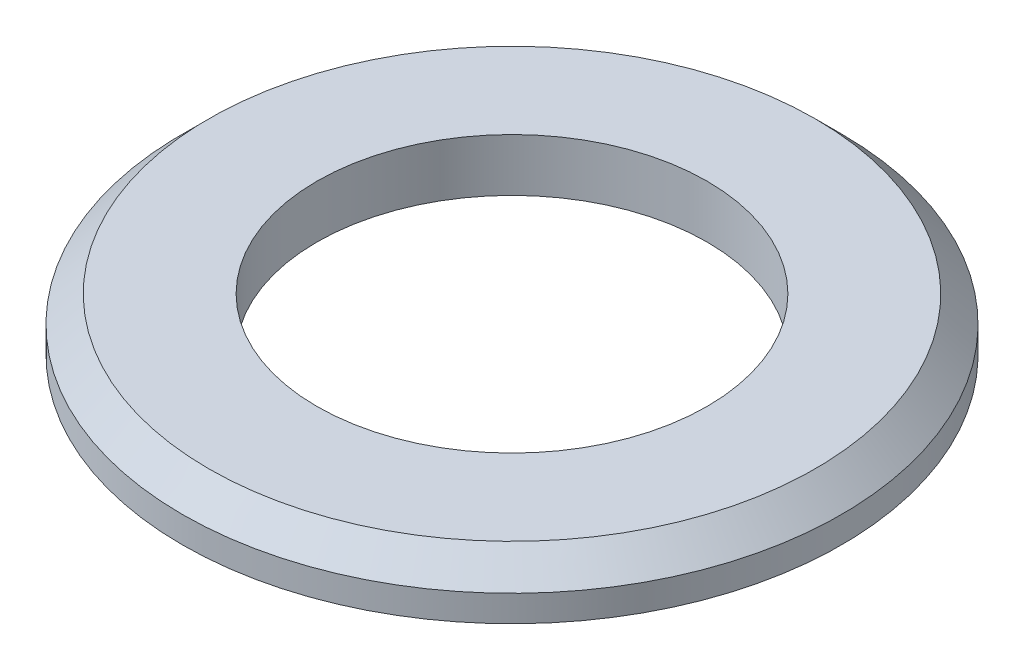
ISO-10303-21;
HEADER;
FILE_DESCRIPTION(('STEP AP214'),'2;1');
FILE_NAME('part.step','',(''),(''),'','','');
FILE_SCHEMA(('AUTOMOTIVE_DESIGN { 1 0 10303 214 1 1 1 1 }'));
ENDSEC;
DATA;
#1=APPLICATION_CONTEXT('core data for automotive mechanical design processes');
#2=APPLICATION_PROTOCOL_DEFINITION('international standard','automotive_design',2000,#1);
#3=PRODUCT_CONTEXT('',#1,'mechanical');
#4=PRODUCT('Part','Part','',(#3));
#5=PRODUCT_RELATED_PRODUCT_CATEGORY('part','',(#4));
#6=PRODUCT_DEFINITION_FORMATION('','',#4);
#7=PRODUCT_DEFINITION_CONTEXT('part definition',#1,'design');
#8=PRODUCT_DEFINITION('design','',#6,#7);
#9=PRODUCT_DEFINITION_SHAPE('','',#8);
#10=(LENGTH_UNIT() NAMED_UNIT(*) SI_UNIT(.MILLI.,.METRE.));
#11=(NAMED_UNIT(*) PLANE_ANGLE_UNIT() SI_UNIT($,.RADIAN.));
#12=(NAMED_UNIT(*) SI_UNIT($,.STERADIAN.) SOLID_ANGLE_UNIT());
#13=UNCERTAINTY_MEASURE_WITH_UNIT(LENGTH_MEASURE(1.E-05),#10,'distance_accuracy_value','');
#14=(GEOMETRIC_REPRESENTATION_CONTEXT(3) GLOBAL_UNCERTAINTY_ASSIGNED_CONTEXT((#13)) GLOBAL_UNIT_ASSIGNED_CONTEXT((#10,
#11,#12)) REPRESENTATION_CONTEXT('',''));
#15=CARTESIAN_POINT('',(0.,0.,0.));
#16=DIRECTION('',(0.,0.,1.));
#17=DIRECTION('',(1.,0.,0.));
#18=AXIS2_PLACEMENT_3D('',#15,#16,#17);
#19=CARTESIAN_POINT('',(0.,10.,0.));
#20=DIRECTION('',(0.,1.,0.));
#21=DIRECTION('',(0.,0.,1.));
#22=AXIS2_PLACEMENT_3D('',#19,#20,#21);
#23=PLANE('',#22);
#24=CARTESIAN_POINT('',(0.,10.,0.));
#25=DIRECTION('',(0.,1.,0.));
#26=DIRECTION('',(0.,0.,1.));
#27=AXIS2_PLACEMENT_3D('',#24,#25,#26);
#28=CIRCLE('',#27,57.5);
#29=CARTESIAN_POINT('',(0.,10.,57.5));
#30=VERTEX_POINT('',#29);
#31=EDGE_CURVE('E35',#30,#30,#28,.T.);
#32=ORIENTED_EDGE('',*,*,#31,.T.);
#33=EDGE_LOOP('',(#32));
#34=FACE_BOUND('',#33,.T.);
#35=CARTESIAN_POINT('',(0.,10.,0.));
#36=DIRECTION('',(0.,1.,0.));
#37=DIRECTION('',(0.,0.,1.));
#38=AXIS2_PLACEMENT_3D('',#35,#36,#37);
#39=CIRCLE('',#38,37.);
#40=CARTESIAN_POINT('',(0.,10.,37.));
#41=VERTEX_POINT('',#40);
#42=EDGE_CURVE('E43',#41,#41,#39,.T.);
#43=ORIENTED_EDGE('',*,*,#42,.F.);
#44=EDGE_LOOP('',(#43));
#45=FACE_BOUND('',#44,.T.);
#46=ADVANCED_FACE('F28',(#34,#45),#23,.T.);
#47=CARTESIAN_POINT('',(0.,0.,0.));
#48=DIRECTION('',(0.,1.,0.));
#49=DIRECTION('',(0.,0.,1.));
#50=AXIS2_PLACEMENT_3D('',#47,#48,#49);
#51=PLANE('',#50);
#52=CARTESIAN_POINT('',(0.,0.,0.));
#53=DIRECTION('',(0.,1.,0.));
#54=DIRECTION('',(0.,0.,1.));
#55=AXIS2_PLACEMENT_3D('',#52,#53,#54);
#56=CIRCLE('',#55,62.5);
#57=CARTESIAN_POINT('',(0.,0.,62.5));
#58=VERTEX_POINT('',#57);
#59=EDGE_CURVE('E39',#58,#58,#56,.T.);
#60=ORIENTED_EDGE('',*,*,#59,.F.);
#61=EDGE_LOOP('',(#60));
#62=FACE_BOUND('',#61,.T.);
#63=CARTESIAN_POINT('',(0.,0.,0.));
#64=DIRECTION('',(0.,1.,0.));
#65=DIRECTION('',(0.,0.,1.));
#66=AXIS2_PLACEMENT_3D('',#63,#64,#65);
#67=CIRCLE('',#66,37.);
#68=CARTESIAN_POINT('',(0.,0.,37.));
#69=VERTEX_POINT('',#68);
#70=EDGE_CURVE('E48',#69,#69,#67,.T.);
#71=ORIENTED_EDGE('',*,*,#70,.T.);
#72=EDGE_LOOP('',(#71));
#73=FACE_BOUND('',#72,.T.);
#74=ADVANCED_FACE('F52',(#62,#73),#51,.F.);
#75=CARTESIAN_POINT('',(0.,10.,0.));
#76=DIRECTION('',(0.,-1.,0.));
#77=DIRECTION('',(0.,0.,-1.));
#78=AXIS2_PLACEMENT_3D('',#75,#76,#77);
#79=CYLINDRICAL_SURFACE('',#78,62.5);
#80=CARTESIAN_POINT('',(0.,4.99999999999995,0.));
#81=DIRECTION('',(0.,1.,0.));
#82=DIRECTION('',(0.,0.,1.));
#83=AXIS2_PLACEMENT_3D('',#80,#81,#82);
#84=CIRCLE('',#83,62.5);
#85=CARTESIAN_POINT('',(0.,4.99999999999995,62.5));
#86=VERTEX_POINT('',#85);
#87=EDGE_CURVE('E10',#86,#86,#84,.F.);
#88=ORIENTED_EDGE('',*,*,#87,.T.);
#89=EDGE_LOOP('',(#88));
#90=FACE_BOUND('',#89,.T.);
#91=ORIENTED_EDGE('',*,*,#59,.T.);
#92=EDGE_LOOP('',(#91));
#93=FACE_BOUND('',#92,.T.);
#94=ADVANCED_FACE('F30',(#90,#93),#79,.T.);
#95=CARTESIAN_POINT('',(0.,10.,0.));
#96=DIRECTION('',(0.,-1.,0.));
#97=DIRECTION('',(0.,0.,-1.));
#98=AXIS2_PLACEMENT_3D('',#95,#96,#97);
#99=CYLINDRICAL_SURFACE('',#98,37.);
#100=ORIENTED_EDGE('',*,*,#42,.T.);
#101=EDGE_LOOP('',(#100));
#102=FACE_BOUND('',#101,.T.);
#103=ORIENTED_EDGE('',*,*,#70,.F.);
#104=EDGE_LOOP('',(#103));
#105=FACE_BOUND('',#104,.T.);
#106=ADVANCED_FACE('F54',(#102,#105),#99,.F.);
#107=CARTESIAN_POINT('',(0.,10.,0.));
#108=DIRECTION('',(0.,-1.,0.));
#109=DIRECTION('',(0.,0.,-1.));
#110=AXIS2_PLACEMENT_3D('',#107,#108,#109);
#111=CONICAL_SURFACE('',#110,57.5,0.785398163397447);
#112=ORIENTED_EDGE('',*,*,#87,.F.);
#113=EDGE_LOOP('',(#112));
#114=FACE_BOUND('',#113,.T.);
#115=ORIENTED_EDGE('',*,*,#31,.F.);
#116=EDGE_LOOP('',(#115));
#117=FACE_BOUND('',#116,.T.);
#118=ADVANCED_FACE('F56',(#114,#117),#111,.T.);
#119=CLOSED_SHELL('',(#46,#74,#94,#106,#118));
#120=MANIFOLD_SOLID_BREP('B2',#119);
#121=ADVANCED_BREP_SHAPE_REPRESENTATION('',(#18,#120),#14);
#122=SHAPE_DEFINITION_REPRESENTATION(#9,#121);
ENDSEC;
END-ISO-10303-21;
